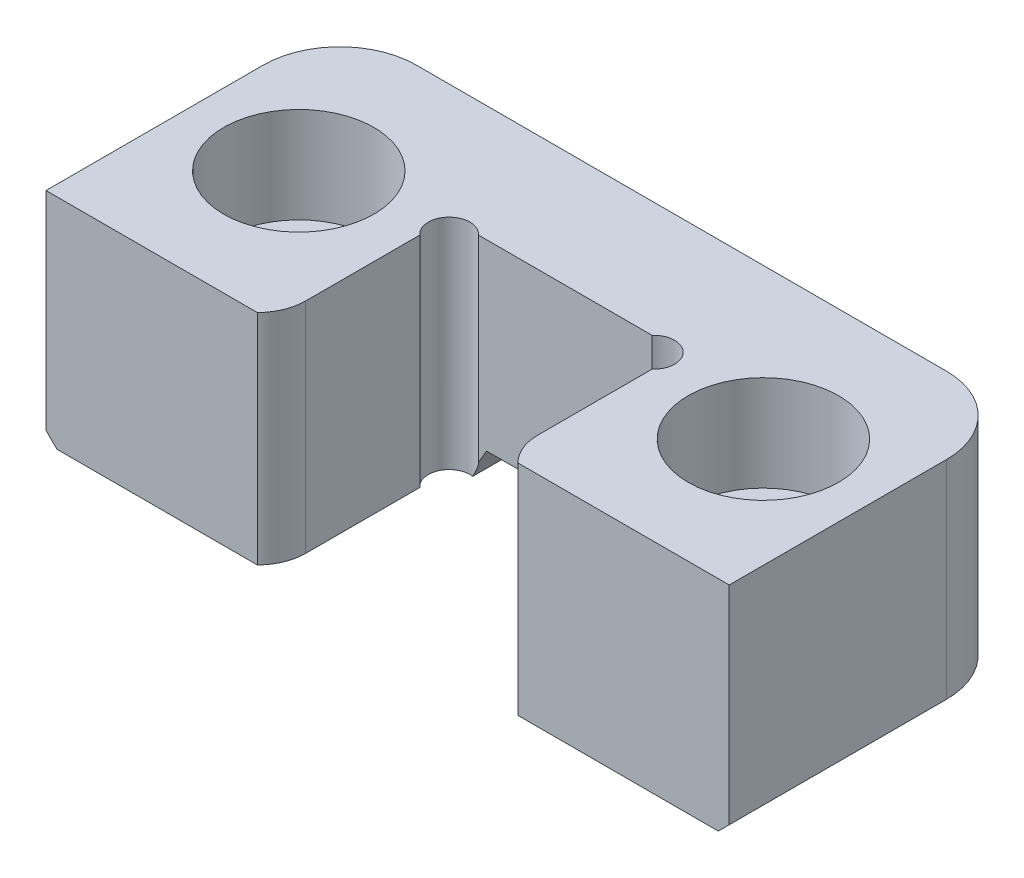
from build123d import *

# Parameters (mm, degrees)
BOSS_EXTRUDE1_DEPTH            = 16
FILLET1_R                      = 5.6
CUT_EXTRUDE1_DEPTH             = 37.650375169
SKETCH3_R                      = 1.52
CUT_EXTRUDE2_DEPTH             = 37.650375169
CUT_EXTRUDE3_DEPTH             = 37.650375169
CHAMFER5_SIZE                  = 3.8
CHAMFER5_SIZE2                 = 1.018206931
CBORE_FOR_M6_SHCS1_D           = 6.6
CBORE_FOR_M6_SHCS1_CBORE_D     = 11
CBORE_FOR_M6_SHCS1_CBORE_DEPTH = 7
CHAMFER6_SIZE                  = 0.8


with BuildPart() as part:
    # Sketch1 → Boss-Extrude1 (new body)
    with BuildSketch(Plane(origin=(0, 0, 0), x_dir=(1, 0, 0), z_dir=(0, 1, 0))):
        Polygon((8.499, 0), (25, 0), (25, 21.5), (-25, 21.5), (-25, 0), (-8.499, 0), (-8.499, 13), (8.499, 13), align=None)
    extrude(amount=-BOSS_EXTRUDE1_DEPTH)

    # Fillet1
    fillet1_edges = [part.edges().sort_by_distance(p)[0] for p in [
        (-25, -8, -21.5),
        (25, -8, -21.5),
    ]]
    fillet(fillet1_edges, radius=FILLET1_R)

    # Sketch2 → Cut-Extrude1 (cut, through all)
    with BuildSketch(Plane(origin=(0, 0, 0), x_dir=(1, 0, 0), z_dir=(0, 1, 0))):
        with BuildLine():
            Line((-8.499, 2.5), (-8.499, 12.7))
            Line((-8.499, 12.7), (8.499, 12.7))
            Line((8.499, 12.7), (8.499, 2.5))
            ThreePointArc((8.499, 2.5), (8.768729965, 1.146594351), (9.536702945, 0))
            Line((9.536702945, 0), (14.849, 0))
            Line((14.849, 0), (14.849, -12.7))
            Line((14.849, -12.7), (-14.849, -12.7))
            Line((-14.849, -12.7), (-14.849, 0))
            Line((-14.849, 0), (-9.536702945, 0))
            ThreePointArc((-9.536702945, 0), (-8.768729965, 1.146594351), (-8.499, 2.5))
        make_face()
    extrude(amount=-CUT_EXTRUDE1_DEPTH, mode=Mode.SUBTRACT)

    # Sketch3 → Cut-Extrude2 (cut, through all)
    with BuildSketch(Plane(origin=(0, 0, 0), x_dir=(1, 0, 0), z_dir=(0, 1, 0))):
        with Locations((-7.489, 11.99)):
            Circle(SKETCH3_R)
        with Locations((7.489, 11.99)):
            Circle(SKETCH3_R)
    extrude(amount=-CUT_EXTRUDE2_DEPTH, mode=Mode.SUBTRACT)

    # Sketch5 → Cut-Extrude3 (cut, through all)
    with BuildSketch(Plane(origin=(0, 0, -21.5), x_dir=(-1, 0, 0), z_dir=(0, 0, -1))):
        Polygon((-6.35, -14.41), (6.35, -14.41), (7.267986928, -16), (-7.267986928, -16), align=None)
    extrude(amount=-CUT_EXTRUDE3_DEPTH, mode=Mode.SUBTRACT)

    # Chamfer5
    chamfer5_edges = [part.edges().sort_by_distance(p)[0] for p in [
        (0, -14.41, -13),
    ]]
    chamfer5_side = [part.faces().sort_by_distance(p)[0] for p in [
        (0, -14.41, -17.25),
    ]]
    chamfer(chamfer5_edges, length=CHAMFER5_SIZE, length2=CHAMFER5_SIZE2, reference=chamfer5_side[0])

    # CBORE for M6 SHCS1 (through all)
    with Locations(Plane(origin=(0, 0, 0), x_dir=(-1, 0, 0), z_dir=(0, 1, 0))):
        with Locations((-17, -10.5), (17, -10.5)):
            CounterBoreHole(CBORE_FOR_M6_SHCS1_D / 2, CBORE_FOR_M6_SHCS1_CBORE_D / 2, CBORE_FOR_M6_SHCS1_CBORE_DEPTH)

    # Chamfer6
    chamfer6_edges = [part.edges().sort_by_distance(p)[0] for p in [
        (25, -16, -7.95),
        (13.333993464, -16, -21.5),
        (-25, -16, -7.95),
        (-23.359797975, -16, -19.859797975),
        (23.359797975, -16, -19.859797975),
        (-13.333993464, -16, -21.5),
    ]]
    chamfer(chamfer6_edges, length=CHAMFER6_SIZE)


solid = part.part
